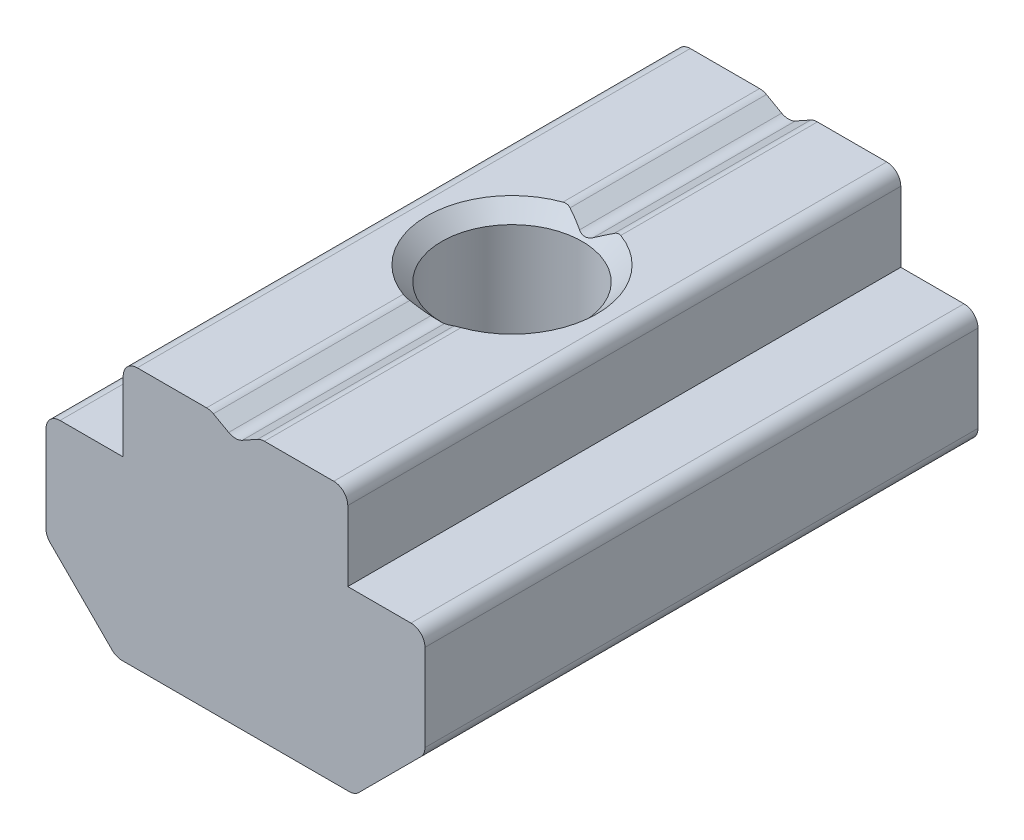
ISO-10303-21;
HEADER;
FILE_DESCRIPTION(('STEP AP214'),'2;1');
FILE_NAME('part.step','',(''),(''),'','','');
FILE_SCHEMA(('AUTOMOTIVE_DESIGN { 1 0 10303 214 1 1 1 1 }'));
ENDSEC;
DATA;
#1=APPLICATION_CONTEXT('core data for automotive mechanical design processes');
#2=APPLICATION_PROTOCOL_DEFINITION('international standard','automotive_design',2000,#1);
#3=PRODUCT_CONTEXT('',#1,'mechanical');
#4=PRODUCT('Part','Part','',(#3));
#5=PRODUCT_RELATED_PRODUCT_CATEGORY('part','',(#4));
#6=PRODUCT_DEFINITION_FORMATION('','',#4);
#7=PRODUCT_DEFINITION_CONTEXT('part definition',#1,'design');
#8=PRODUCT_DEFINITION('design','',#6,#7);
#9=PRODUCT_DEFINITION_SHAPE('','',#8);
#10=(LENGTH_UNIT() NAMED_UNIT(*) SI_UNIT(.MILLI.,.METRE.));
#11=(NAMED_UNIT(*) PLANE_ANGLE_UNIT() SI_UNIT($,.RADIAN.));
#12=(NAMED_UNIT(*) SI_UNIT($,.STERADIAN.) SOLID_ANGLE_UNIT());
#13=UNCERTAINTY_MEASURE_WITH_UNIT(LENGTH_MEASURE(1.E-05),#10,'distance_accuracy_value','');
#14=(GEOMETRIC_REPRESENTATION_CONTEXT(3) GLOBAL_UNCERTAINTY_ASSIGNED_CONTEXT((#13)) GLOBAL_UNIT_ASSIGNED_CONTEXT((#10,
#11,#12)) REPRESENTATION_CONTEXT('',''));
#15=CARTESIAN_POINT('',(0.,0.,0.));
#16=DIRECTION('',(0.,0.,1.));
#17=DIRECTION('',(1.,0.,0.));
#18=AXIS2_PLACEMENT_3D('',#15,#16,#17);
#19=CARTESIAN_POINT('',(0.,9.3,0.));
#20=DIRECTION('',(0.,0.,-1.));
#21=DIRECTION('',(-1.,0.,0.));
#22=AXIS2_PLACEMENT_3D('',#19,#20,#21);
#23=PLANE('',#22);
#24=DIRECTION('',(1.,0.,0.));
#25=VECTOR('',#24,1.);
#26=CARTESIAN_POINT('',(0.,9.3,0.));
#27=LINE('',#26,#25);
#28=CARTESIAN_POINT('',(7.7795630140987,9.3,0.));
#29=VERTEX_POINT('',#28);
#30=CARTESIAN_POINT('',(10.25,9.3,0.));
#31=VERTEX_POINT('',#30);
#32=EDGE_CURVE('E304',#29,#31,#27,.T.);
#33=ORIENTED_EDGE('',*,*,#32,.F.);
#34=CARTESIAN_POINT('',(7.7795630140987,8.8,0.));
#35=DIRECTION('',(0.,0.,-1.));
#36=DIRECTION('',(-1.,0.,0.));
#37=AXIS2_PLACEMENT_3D('',#34,#35,#36);
#38=CIRCLE('',#37,0.5);
#39=CARTESIAN_POINT('',(7.53674154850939,9.23707863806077,0.));
#40=VERTEX_POINT('',#39);
#41=EDGE_CURVE('E424',#29,#40,#38,.F.);
#42=ORIENTED_EDGE('',*,*,#41,.T.);
#43=DIRECTION('',(-0.874157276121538,-0.485642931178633,0.));
#44=VECTOR('',#43,1.);
#45=CARTESIAN_POINT('',(-2.1438679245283,3.85896226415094,0.));
#46=LINE('',#45,#44);
#47=CARTESIAN_POINT('',(6.99282146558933,8.93490081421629,0.));
#48=VERTEX_POINT('',#47);
#49=EDGE_CURVE('E680',#40,#48,#46,.T.);
#50=ORIENTED_EDGE('',*,*,#49,.T.);
#51=CARTESIAN_POINT('',(6.75000000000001,9.37197945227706,0.));
#52=DIRECTION('',(0.,0.,-1.));
#53=DIRECTION('',(-1.,0.,0.));
#54=AXIS2_PLACEMENT_3D('',#51,#52,#53);
#55=CIRCLE('',#54,0.5);
#56=CARTESIAN_POINT('',(6.50717853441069,8.93490081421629,0.));
#57=VERTEX_POINT('',#56);
#58=EDGE_CURVE('E60',#48,#57,#55,.T.);
#59=ORIENTED_EDGE('',*,*,#58,.T.);
#60=DIRECTION('',(0.874157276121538,-0.485642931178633,0.));
#61=VECTOR('',#60,1.);
#62=CARTESIAN_POINT('',(5.32783018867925,9.59009433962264,0.));
#63=LINE('',#62,#61);
#64=CARTESIAN_POINT('',(5.96325845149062,9.23707863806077,0.));
#65=VERTEX_POINT('',#64);
#66=EDGE_CURVE('E670',#65,#57,#63,.T.);
#67=ORIENTED_EDGE('',*,*,#66,.F.);
#68=CARTESIAN_POINT('',(5.72043698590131,8.8,0.));
#69=DIRECTION('',(0.,0.,-1.));
#70=DIRECTION('',(-1.,0.,0.));
#71=AXIS2_PLACEMENT_3D('',#68,#69,#70);
#72=CIRCLE('',#71,0.5);
#73=CARTESIAN_POINT('',(5.72043698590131,9.3,0.));
#74=VERTEX_POINT('',#73);
#75=EDGE_CURVE('E421',#65,#74,#72,.F.);
#76=ORIENTED_EDGE('',*,*,#75,.T.);
#77=CARTESIAN_POINT('',(3.25,9.3,0.));
#78=VERTEX_POINT('',#77);
#79=EDGE_CURVE('E299',#78,#74,#27,.T.);
#80=ORIENTED_EDGE('',*,*,#79,.F.);
#81=CARTESIAN_POINT('',(3.25,8.8,0.));
#82=DIRECTION('',(0.,0.,-1.));
#83=DIRECTION('',(-1.,0.,0.));
#84=AXIS2_PLACEMENT_3D('',#81,#82,#83);
#85=CIRCLE('',#84,0.5);
#86=CARTESIAN_POINT('',(2.75,8.8,0.));
#87=VERTEX_POINT('',#86);
#88=EDGE_CURVE('E397',#78,#87,#85,.F.);
#89=ORIENTED_EDGE('',*,*,#88,.T.);
#90=DIRECTION('',(0.,1.,0.));
#91=VECTOR('',#90,1.);
#92=CARTESIAN_POINT('',(2.75,6.3,0.));
#93=LINE('',#92,#91);
#94=CARTESIAN_POINT('',(2.75,6.3,0.));
#95=VERTEX_POINT('',#94);
#96=EDGE_CURVE('E256',#95,#87,#93,.T.);
#97=ORIENTED_EDGE('',*,*,#96,.F.);
#98=DIRECTION('',(1.,0.,0.));
#99=VECTOR('',#98,1.);
#100=CARTESIAN_POINT('',(0.,6.3,0.));
#101=LINE('',#100,#99);
#102=CARTESIAN_POINT('',(0.5,6.3,0.));
#103=VERTEX_POINT('',#102);
#104=EDGE_CURVE('E257',#103,#95,#101,.T.);
#105=ORIENTED_EDGE('',*,*,#104,.F.);
#106=CARTESIAN_POINT('',(0.5,5.8,0.));
#107=DIRECTION('',(0.,0.,-1.));
#108=DIRECTION('',(-1.,0.,0.));
#109=AXIS2_PLACEMENT_3D('',#106,#107,#108);
#110=CIRCLE('',#109,0.5);
#111=CARTESIAN_POINT('',(0.,5.8,0.));
#112=VERTEX_POINT('',#111);
#113=EDGE_CURVE('E400',#103,#112,#110,.F.);
#114=ORIENTED_EDGE('',*,*,#113,.T.);
#115=DIRECTION('',(0.,-1.,0.));
#116=VECTOR('',#115,1.);
#117=CARTESIAN_POINT('',(0.,9.3,0.));
#118=LINE('',#117,#116);
#119=CARTESIAN_POINT('',(0.,2.70710678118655,0.));
#120=VERTEX_POINT('',#119);
#121=EDGE_CURVE('E328',#112,#120,#118,.T.);
#122=ORIENTED_EDGE('',*,*,#121,.T.);
#123=CARTESIAN_POINT('',(0.5,2.70710678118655,0.));
#124=DIRECTION('',(0.,0.,-1.));
#125=DIRECTION('',(-1.,0.,0.));
#126=AXIS2_PLACEMENT_3D('',#123,#124,#125);
#127=CIRCLE('',#126,0.5);
#128=CARTESIAN_POINT('',(0.146446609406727,2.35355339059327,0.));
#129=VERTEX_POINT('',#128);
#130=EDGE_CURVE('E418',#120,#129,#127,.F.);
#131=ORIENTED_EDGE('',*,*,#130,.T.);
#132=DIRECTION('',(0.707106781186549,-0.707106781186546,0.));
#133=VECTOR('',#132,1.);
#134=CARTESIAN_POINT('',(0.,2.5,0.));
#135=LINE('',#134,#133);
#136=CARTESIAN_POINT('',(2.35355339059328,0.146446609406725,0.));
#137=VERTEX_POINT('',#136);
#138=EDGE_CURVE('E336',#129,#137,#135,.T.);
#139=ORIENTED_EDGE('',*,*,#138,.T.);
#140=CARTESIAN_POINT('',(2.70710678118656,0.5,0.));
#141=DIRECTION('',(0.,0.,-1.));
#142=DIRECTION('',(-1.,0.,0.));
#143=AXIS2_PLACEMENT_3D('',#140,#141,#142);
#144=CIRCLE('',#143,0.5);
#145=CARTESIAN_POINT('',(2.70710678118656,0.,0.));
#146=VERTEX_POINT('',#145);
#147=EDGE_CURVE('E415',#137,#146,#144,.F.);
#148=ORIENTED_EDGE('',*,*,#147,.T.);
#149=DIRECTION('',(1.,0.,0.));
#150=VECTOR('',#149,1.);
#151=CARTESIAN_POINT('',(0.,0.,0.));
#152=LINE('',#151,#150);
#153=CARTESIAN_POINT('',(10.7928932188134,0.,0.));
#154=VERTEX_POINT('',#153);
#155=EDGE_CURVE('E278',#146,#154,#152,.T.);
#156=ORIENTED_EDGE('',*,*,#155,.T.);
#157=CARTESIAN_POINT('',(10.7928932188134,0.5,0.));
#158=DIRECTION('',(0.,0.,-1.));
#159=DIRECTION('',(-1.,0.,0.));
#160=AXIS2_PLACEMENT_3D('',#157,#158,#159);
#161=CIRCLE('',#160,0.5);
#162=CARTESIAN_POINT('',(11.1464466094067,0.146446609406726,0.));
#163=VERTEX_POINT('',#162);
#164=EDGE_CURVE('E412',#154,#163,#161,.F.);
#165=ORIENTED_EDGE('',*,*,#164,.T.);
#166=DIRECTION('',(0.707106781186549,0.707106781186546,0.));
#167=VECTOR('',#166,1.);
#168=CARTESIAN_POINT('',(13.5,2.5,0.));
#169=LINE('',#168,#167);
#170=CARTESIAN_POINT('',(13.3535533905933,2.35355339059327,0.));
#171=VERTEX_POINT('',#170);
#172=EDGE_CURVE('E332',#163,#171,#169,.T.);
#173=ORIENTED_EDGE('',*,*,#172,.T.);
#174=CARTESIAN_POINT('',(13.,2.70710678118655,0.));
#175=DIRECTION('',(0.,0.,-1.));
#176=DIRECTION('',(-1.,0.,0.));
#177=AXIS2_PLACEMENT_3D('',#174,#175,#176);
#178=CIRCLE('',#177,0.5);
#179=CARTESIAN_POINT('',(13.5,2.70710678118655,0.));
#180=VERTEX_POINT('',#179);
#181=EDGE_CURVE('E409',#171,#180,#178,.F.);
#182=ORIENTED_EDGE('',*,*,#181,.T.);
#183=DIRECTION('',(0.,-1.,0.));
#184=VECTOR('',#183,1.);
#185=CARTESIAN_POINT('',(13.5,9.3,0.));
#186=LINE('',#185,#184);
#187=CARTESIAN_POINT('',(13.5,5.8,0.));
#188=VERTEX_POINT('',#187);
#189=EDGE_CURVE('E324',#188,#180,#186,.T.);
#190=ORIENTED_EDGE('',*,*,#189,.F.);
#191=CARTESIAN_POINT('',(13.,5.8,0.));
#192=DIRECTION('',(0.,0.,-1.));
#193=DIRECTION('',(-1.,0.,0.));
#194=AXIS2_PLACEMENT_3D('',#191,#192,#193);
#195=CIRCLE('',#194,0.5);
#196=CARTESIAN_POINT('',(13.,6.3,0.));
#197=VERTEX_POINT('',#196);
#198=EDGE_CURVE('E403',#188,#197,#195,.F.);
#199=ORIENTED_EDGE('',*,*,#198,.T.);
#200=DIRECTION('',(1.,0.,0.));
#201=VECTOR('',#200,1.);
#202=CARTESIAN_POINT('',(0.,6.3,0.));
#203=LINE('',#202,#201);
#204=CARTESIAN_POINT('',(10.75,6.3,0.));
#205=VERTEX_POINT('',#204);
#206=EDGE_CURVE('E288',#205,#197,#203,.T.);
#207=ORIENTED_EDGE('',*,*,#206,.F.);
#208=DIRECTION('',(0.,1.,0.));
#209=VECTOR('',#208,1.);
#210=CARTESIAN_POINT('',(10.75,6.3,0.));
#211=LINE('',#210,#209);
#212=CARTESIAN_POINT('',(10.75,8.8,0.));
#213=VERTEX_POINT('',#212);
#214=EDGE_CURVE('E266',#205,#213,#211,.T.);
#215=ORIENTED_EDGE('',*,*,#214,.T.);
#216=CARTESIAN_POINT('',(10.25,8.8,0.));
#217=DIRECTION('',(0.,0.,-1.));
#218=DIRECTION('',(-1.,0.,0.));
#219=AXIS2_PLACEMENT_3D('',#216,#217,#218);
#220=CIRCLE('',#219,0.5);
#221=EDGE_CURVE('E406',#213,#31,#220,.F.);
#222=ORIENTED_EDGE('',*,*,#221,.T.);
#223=EDGE_LOOP('',(#33,#42,#50,#59,#67,#76,#80,#89,#97,#105,#114,#122,#131,#139,#148,#156,#165,
#173,#182,#190,#199,#207,#215,#222));
#224=FACE_BOUND('',#223,.T.);
#225=ADVANCED_FACE('F45',(#224),#23,.F.);
#226=CARTESIAN_POINT('',(0.,9.3,-19.7));
#227=DIRECTION('',(0.,0.,1.));
#228=DIRECTION('',(1.,0.,0.));
#229=AXIS2_PLACEMENT_3D('',#226,#227,#228);
#230=PLANE('',#229);
#231=DIRECTION('',(0.874157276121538,0.485642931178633,0.));
#232=VECTOR('',#231,1.);
#233=CARTESIAN_POINT('',(-2.1438679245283,3.85896226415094,-19.7));
#234=LINE('',#233,#232);
#235=CARTESIAN_POINT('',(6.99282146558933,8.93490081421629,-19.7));
#236=VERTEX_POINT('',#235);
#237=CARTESIAN_POINT('',(7.53674154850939,9.23707863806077,-19.7));
#238=VERTEX_POINT('',#237);
#239=EDGE_CURVE('E683',#236,#238,#234,.T.);
#240=ORIENTED_EDGE('',*,*,#239,.T.);
#241=CARTESIAN_POINT('',(7.7795630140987,8.8,-19.7));
#242=DIRECTION('',(0.,0.,1.));
#243=DIRECTION('',(1.,0.,0.));
#244=AXIS2_PLACEMENT_3D('',#241,#242,#243);
#245=CIRCLE('',#244,0.5);
#246=CARTESIAN_POINT('',(7.7795630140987,9.3,-19.7));
#247=VERTEX_POINT('',#246);
#248=EDGE_CURVE('E621',#238,#247,#245,.F.);
#249=ORIENTED_EDGE('',*,*,#248,.T.);
#250=DIRECTION('',(-1.,0.,0.));
#251=VECTOR('',#250,1.);
#252=CARTESIAN_POINT('',(0.,9.3,-19.7));
#253=LINE('',#252,#251);
#254=CARTESIAN_POINT('',(10.25,9.3,-19.7));
#255=VERTEX_POINT('',#254);
#256=EDGE_CURVE('E308',#255,#247,#253,.T.);
#257=ORIENTED_EDGE('',*,*,#256,.F.);
#258=CARTESIAN_POINT('',(10.25,8.8,-19.7));
#259=DIRECTION('',(0.,0.,1.));
#260=DIRECTION('',(1.,0.,0.));
#261=AXIS2_PLACEMENT_3D('',#258,#259,#260);
#262=CIRCLE('',#261,0.5);
#263=CARTESIAN_POINT('',(10.75,8.8,-19.7));
#264=VERTEX_POINT('',#263);
#265=EDGE_CURVE('E596',#255,#264,#262,.F.);
#266=ORIENTED_EDGE('',*,*,#265,.T.);
#267=DIRECTION('',(0.,1.,0.));
#268=VECTOR('',#267,1.);
#269=CARTESIAN_POINT('',(10.75,6.3,-19.7));
#270=LINE('',#269,#268);
#271=CARTESIAN_POINT('',(10.75,6.3,-19.7));
#272=VERTEX_POINT('',#271);
#273=EDGE_CURVE('E292',#272,#264,#270,.T.);
#274=ORIENTED_EDGE('',*,*,#273,.F.);
#275=DIRECTION('',(-1.,0.,0.));
#276=VECTOR('',#275,1.);
#277=CARTESIAN_POINT('',(0.,6.3,-19.7));
#278=LINE('',#277,#276);
#279=CARTESIAN_POINT('',(13.,6.3,-19.7));
#280=VERTEX_POINT('',#279);
#281=EDGE_CURVE('E280',#280,#272,#278,.T.);
#282=ORIENTED_EDGE('',*,*,#281,.F.);
#283=CARTESIAN_POINT('',(13.,5.8,-19.7));
#284=DIRECTION('',(0.,0.,1.));
#285=DIRECTION('',(1.,0.,0.));
#286=AXIS2_PLACEMENT_3D('',#283,#284,#285);
#287=CIRCLE('',#286,0.5);
#288=CARTESIAN_POINT('',(13.5,5.8,-19.7));
#289=VERTEX_POINT('',#288);
#290=EDGE_CURVE('E645',#280,#289,#287,.F.);
#291=ORIENTED_EDGE('',*,*,#290,.T.);
#292=DIRECTION('',(0.,-1.,0.));
#293=VECTOR('',#292,1.);
#294=CARTESIAN_POINT('',(13.5,9.3,-19.7));
#295=LINE('',#294,#293);
#296=CARTESIAN_POINT('',(13.5,2.70710678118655,-19.7));
#297=VERTEX_POINT('',#296);
#298=EDGE_CURVE('E320',#289,#297,#295,.T.);
#299=ORIENTED_EDGE('',*,*,#298,.T.);
#300=CARTESIAN_POINT('',(13.,2.70710678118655,-19.7));
#301=DIRECTION('',(0.,0.,1.));
#302=DIRECTION('',(1.,0.,0.));
#303=AXIS2_PLACEMENT_3D('',#300,#301,#302);
#304=CIRCLE('',#303,0.5);
#305=CARTESIAN_POINT('',(13.3535533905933,2.35355339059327,-19.7));
#306=VERTEX_POINT('',#305);
#307=EDGE_CURVE('E593',#297,#306,#304,.F.);
#308=ORIENTED_EDGE('',*,*,#307,.T.);
#309=DIRECTION('',(-0.707106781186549,-0.707106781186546,0.));
#310=VECTOR('',#309,1.);
#311=CARTESIAN_POINT('',(13.5,2.5,-19.7));
#312=LINE('',#311,#310);
#313=CARTESIAN_POINT('',(11.1464466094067,0.146446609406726,-19.7));
#314=VERTEX_POINT('',#313);
#315=EDGE_CURVE('E340',#306,#314,#312,.T.);
#316=ORIENTED_EDGE('',*,*,#315,.T.);
#317=CARTESIAN_POINT('',(10.7928932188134,0.5,-19.7));
#318=DIRECTION('',(0.,0.,1.));
#319=DIRECTION('',(1.,0.,0.));
#320=AXIS2_PLACEMENT_3D('',#317,#318,#319);
#321=CIRCLE('',#320,0.5);
#322=CARTESIAN_POINT('',(10.7928932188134,0.,-19.7));
#323=VERTEX_POINT('',#322);
#324=EDGE_CURVE('E595',#314,#323,#321,.F.);
#325=ORIENTED_EDGE('',*,*,#324,.T.);
#326=DIRECTION('',(-1.,0.,0.));
#327=VECTOR('',#326,1.);
#328=CARTESIAN_POINT('',(0.,0.,-19.7));
#329=LINE('',#328,#327);
#330=CARTESIAN_POINT('',(2.70710678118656,0.,-19.7));
#331=VERTEX_POINT('',#330);
#332=EDGE_CURVE('E312',#323,#331,#329,.T.);
#333=ORIENTED_EDGE('',*,*,#332,.T.);
#334=CARTESIAN_POINT('',(2.70710678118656,0.5,-19.7));
#335=DIRECTION('',(0.,0.,1.));
#336=DIRECTION('',(1.,0.,0.));
#337=AXIS2_PLACEMENT_3D('',#334,#335,#336);
#338=CIRCLE('',#337,0.5);
#339=CARTESIAN_POINT('',(2.35355339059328,0.146446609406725,-19.7));
#340=VERTEX_POINT('',#339);
#341=EDGE_CURVE('E637',#331,#340,#338,.F.);
#342=ORIENTED_EDGE('',*,*,#341,.T.);
#343=DIRECTION('',(-0.707106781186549,0.707106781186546,0.));
#344=VECTOR('',#343,1.);
#345=CARTESIAN_POINT('',(0.,2.5,-19.7));
#346=LINE('',#345,#344);
#347=CARTESIAN_POINT('',(0.146446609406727,2.35355339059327,-19.7));
#348=VERTEX_POINT('',#347);
#349=EDGE_CURVE('E344',#340,#348,#346,.T.);
#350=ORIENTED_EDGE('',*,*,#349,.T.);
#351=CARTESIAN_POINT('',(0.5,2.70710678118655,-19.7));
#352=DIRECTION('',(0.,0.,1.));
#353=DIRECTION('',(1.,0.,0.));
#354=AXIS2_PLACEMENT_3D('',#351,#352,#353);
#355=CIRCLE('',#354,0.5);
#356=CARTESIAN_POINT('',(0.,2.70710678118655,-19.7));
#357=VERTEX_POINT('',#356);
#358=EDGE_CURVE('E551',#348,#357,#355,.F.);
#359=ORIENTED_EDGE('',*,*,#358,.T.);
#360=DIRECTION('',(0.,-1.,0.));
#361=VECTOR('',#360,1.);
#362=CARTESIAN_POINT('',(0.,9.3,-19.7));
#363=LINE('',#362,#361);
#364=CARTESIAN_POINT('',(0.,5.8,-19.7));
#365=VERTEX_POINT('',#364);
#366=EDGE_CURVE('E316',#365,#357,#363,.T.);
#367=ORIENTED_EDGE('',*,*,#366,.F.);
#368=CARTESIAN_POINT('',(0.5,5.8,-19.7));
#369=DIRECTION('',(0.,0.,1.));
#370=DIRECTION('',(1.,0.,0.));
#371=AXIS2_PLACEMENT_3D('',#368,#369,#370);
#372=CIRCLE('',#371,0.5);
#373=CARTESIAN_POINT('',(0.5,6.3,-19.7));
#374=VERTEX_POINT('',#373);
#375=EDGE_CURVE('E75',#365,#374,#372,.F.);
#376=ORIENTED_EDGE('',*,*,#375,.T.);
#377=DIRECTION('',(-1.,0.,0.));
#378=VECTOR('',#377,1.);
#379=CARTESIAN_POINT('',(0.,6.3,-19.7));
#380=LINE('',#379,#378);
#381=CARTESIAN_POINT('',(2.75,6.3,-19.7));
#382=VERTEX_POINT('',#381);
#383=EDGE_CURVE('E262',#382,#374,#380,.T.);
#384=ORIENTED_EDGE('',*,*,#383,.F.);
#385=DIRECTION('',(0.,1.,0.));
#386=VECTOR('',#385,1.);
#387=CARTESIAN_POINT('',(2.75,6.3,-19.7));
#388=LINE('',#387,#386);
#389=CARTESIAN_POINT('',(2.75,8.8,-19.7));
#390=VERTEX_POINT('',#389);
#391=EDGE_CURVE('E249',#382,#390,#388,.T.);
#392=ORIENTED_EDGE('',*,*,#391,.T.);
#393=CARTESIAN_POINT('',(3.25,8.8,-19.7));
#394=DIRECTION('',(0.,0.,1.));
#395=DIRECTION('',(1.,0.,0.));
#396=AXIS2_PLACEMENT_3D('',#393,#394,#395);
#397=CIRCLE('',#396,0.5);
#398=CARTESIAN_POINT('',(3.25,9.3,-19.7));
#399=VERTEX_POINT('',#398);
#400=EDGE_CURVE('E650',#390,#399,#397,.F.);
#401=ORIENTED_EDGE('',*,*,#400,.T.);
#402=CARTESIAN_POINT('',(5.72043698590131,9.3,-19.7));
#403=VERTEX_POINT('',#402);
#404=EDGE_CURVE('E303',#403,#399,#253,.T.);
#405=ORIENTED_EDGE('',*,*,#404,.F.);
#406=CARTESIAN_POINT('',(5.72043698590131,8.8,-19.7));
#407=DIRECTION('',(0.,0.,1.));
#408=DIRECTION('',(1.,0.,0.));
#409=AXIS2_PLACEMENT_3D('',#406,#407,#408);
#410=CIRCLE('',#409,0.5);
#411=CARTESIAN_POINT('',(5.96325845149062,9.23707863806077,-19.7));
#412=VERTEX_POINT('',#411);
#413=EDGE_CURVE('E625',#403,#412,#410,.F.);
#414=ORIENTED_EDGE('',*,*,#413,.T.);
#415=DIRECTION('',(-0.874157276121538,0.485642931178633,0.));
#416=VECTOR('',#415,1.);
#417=CARTESIAN_POINT('',(5.32783018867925,9.59009433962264,-19.7));
#418=LINE('',#417,#416);
#419=CARTESIAN_POINT('',(6.50717853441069,8.93490081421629,-19.7));
#420=VERTEX_POINT('',#419);
#421=EDGE_CURVE('E686',#420,#412,#418,.T.);
#422=ORIENTED_EDGE('',*,*,#421,.F.);
#423=CARTESIAN_POINT('',(6.75000000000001,9.37197945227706,-19.7));
#424=DIRECTION('',(0.,0.,1.));
#425=DIRECTION('',(1.,0.,0.));
#426=AXIS2_PLACEMENT_3D('',#423,#424,#425);
#427=CIRCLE('',#426,0.5);
#428=EDGE_CURVE('E486',#420,#236,#427,.T.);
#429=ORIENTED_EDGE('',*,*,#428,.T.);
#430=EDGE_LOOP('',(#240,#249,#257,#266,#274,#282,#291,#299,#308,#316,#325,#333,#342,#350,#359,
#367,#376,#384,#392,#401,#405,#414,#422,#429));
#431=FACE_BOUND('',#430,.T.);
#432=ADVANCED_FACE('F269',(#431),#230,.F.);
#433=CARTESIAN_POINT('',(0.,9.3,0.));
#434=DIRECTION('',(0.,-1.,0.));
#435=DIRECTION('',(0.,0.,-1.));
#436=AXIS2_PLACEMENT_3D('',#433,#434,#435);
#437=PLANE('',#436);
#438=CARTESIAN_POINT('',(6.75,9.3,-9.85));
#439=DIRECTION('',(0.,1.,0.));
#440=DIRECTION('',(0.,0.,1.));
#441=AXIS2_PLACEMENT_3D('',#438,#439,#440);
#442=CIRCLE('',#441,3.025);
#443=CARTESIAN_POINT('',(7.7795630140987,9.3,-7.0055976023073));
#444=VERTEX_POINT('',#443);
#445=CARTESIAN_POINT('',(7.7795630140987,9.3,-12.6944023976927));
#446=VERTEX_POINT('',#445);
#447=EDGE_CURVE('E613',#444,#446,#442,.T.);
#448=ORIENTED_EDGE('',*,*,#447,.F.);
#449=DIRECTION('',(0.,0.,1.));
#450=VECTOR('',#449,1.);
#451=CARTESIAN_POINT('',(7.7795630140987,9.3,0.));
#452=LINE('',#451,#450);
#453=EDGE_CURVE('E393',#444,#29,#452,.T.);
#454=ORIENTED_EDGE('',*,*,#453,.T.);
#455=ORIENTED_EDGE('',*,*,#32,.T.);
#456=DIRECTION('',(0.,0.,1.));
#457=VECTOR('',#456,1.);
#458=CARTESIAN_POINT('',(10.25,9.3,0.));
#459=LINE('',#458,#457);
#460=EDGE_CURVE('E386',#31,#255,#459,.F.);
#461=ORIENTED_EDGE('',*,*,#460,.T.);
#462=ORIENTED_EDGE('',*,*,#256,.T.);
#463=DIRECTION('',(0.,0.,1.));
#464=VECTOR('',#463,1.);
#465=CARTESIAN_POINT('',(7.7795630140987,9.3,-12.7380140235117));
#466=LINE('',#465,#464);
#467=EDGE_CURVE('E389',#247,#446,#466,.T.);
#468=ORIENTED_EDGE('',*,*,#467,.T.);
#469=EDGE_LOOP('',(#448,#454,#455,#461,#462,#468));
#470=FACE_BOUND('',#469,.T.);
#471=ADVANCED_FACE('F451',(#470),#437,.F.);
#472=CARTESIAN_POINT('',(6.75,9.3,-9.85));
#473=DIRECTION('',(0.,1.,0.));
#474=DIRECTION('',(0.,0.,1.));
#475=AXIS2_PLACEMENT_3D('',#472,#473,#474);
#476=CONICAL_SURFACE('',#475,3.025,0.785398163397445);
#477=CARTESIAN_POINT('',(6.75,8.775,-9.85));
#478=DIRECTION('',(0.,1.,0.));
#479=DIRECTION('',(0.,0.,1.));
#480=AXIS2_PLACEMENT_3D('',#477,#478,#479);
#481=CIRCLE('',#480,2.5);
#482=CARTESIAN_POINT('',(6.75,8.775,-7.35));
#483=VERTEX_POINT('',#482);
#484=EDGE_CURVE('E698',#483,#483,#481,.T.);
#485=ORIENTED_EDGE('',*,*,#484,.F.);
#486=EDGE_LOOP('',(#485));
#487=FACE_BOUND('',#486,.T.);
#488=CARTESIAN_POINT('',(8.77901785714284,9.92723214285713,-9.85));
#489=DIRECTION('',(-0.485642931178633,0.874157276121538,0.));
#490=DIRECTION('',(0.874157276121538,0.485642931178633,0.));
#491=AXIS2_PLACEMENT_3D('',#488,#489,#490);
#492=ELLIPSE('',#491,4.17800348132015,3.03675586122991);
#493=CARTESIAN_POINT('',(7.53674154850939,9.23707863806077,-6.99431311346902));
#494=VERTEX_POINT('',#493);
#495=CARTESIAN_POINT('',(6.99282146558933,8.93490081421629,-7.2012059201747));
#496=VERTEX_POINT('',#495);
#497=EDGE_CURVE('E353',#494,#496,#492,.F.);
#498=ORIENTED_EDGE('',*,*,#497,.F.);
#499=CARTESIAN_POINT('',(7.53674154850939,9.23707863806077,-6.99431311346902));
#500=CARTESIAN_POINT('',(7.55232730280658,9.2457696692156,-6.98958949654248));
#501=CARTESIAN_POINT('',(7.5686790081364,9.25373000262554,-6.9859395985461));
#502=CARTESIAN_POINT('',(7.60242480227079,9.26792002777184,-6.98099698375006));
#503=CARTESIAN_POINT('',(7.61981751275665,9.27415194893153,-6.97970121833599));
#504=CARTESIAN_POINT('',(7.65526015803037,9.28465801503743,-6.97966323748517));
#505=CARTESIAN_POINT('',(7.67331216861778,9.28892527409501,-6.98092992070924));
#506=CARTESIAN_POINT('',(7.70940935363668,9.29539248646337,-6.98597750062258));
#507=CARTESIAN_POINT('',(7.72745450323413,9.29759527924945,-6.98975493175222));
#508=CARTESIAN_POINT('',(7.75101899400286,9.29921866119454,-6.99624880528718));
#509=CARTESIAN_POINT('',(7.75678033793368,9.29951373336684,-6.99796336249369));
#510=CARTESIAN_POINT('',(7.7682275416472,9.29990407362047,-7.00161569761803));
#511=CARTESIAN_POINT('',(7.77391351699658,9.29999969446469,-7.00355307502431));
#512=CARTESIAN_POINT('',(7.7795630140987,9.3,-7.0055976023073));
#513=B_SPLINE_CURVE_WITH_KNOTS('',3,(#499,#500,#501,#502,#503,#504,#505,#506,#507,#508,#509,
#510,#511,#512),.UNSPECIFIED.,.F.,.F.,(4,2,2,2,2,2,4),(0.,0.0553649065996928,0.110658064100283,
0.166143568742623,0.221552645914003,0.239602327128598,0.25762005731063),.UNSPECIFIED.);
#514=EDGE_CURVE('E469',#494,#444,#513,.T.);
#515=ORIENTED_EDGE('',*,*,#514,.T.);
#516=ORIENTED_EDGE('',*,*,#447,.T.);
#517=CARTESIAN_POINT('',(7.7795630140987,9.3,-12.6944023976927));
#518=CARTESIAN_POINT('',(7.76221561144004,9.3000261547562,-12.7007162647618));
#519=CARTESIAN_POINT('',(7.74444860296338,9.29909806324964,-12.7059737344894));
#520=CARTESIAN_POINT('',(7.7086113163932,9.29526102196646,-12.7141515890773));
#521=CARTESIAN_POINT('',(7.69054125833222,9.29235345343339,-12.7170736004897));
#522=CARTESIAN_POINT('',(7.65454017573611,9.28447044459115,-12.7203718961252));
#523=CARTESIAN_POINT('',(7.63660993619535,9.27948721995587,-12.7207385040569));
#524=CARTESIAN_POINT('',(7.60155815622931,9.26760623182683,-12.7189393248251));
#525=CARTESIAN_POINT('',(7.58443535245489,9.26071158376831,-12.716777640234));
#526=CARTESIAN_POINT('',(7.56260628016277,9.25051627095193,-12.7124101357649));
#527=CARTESIAN_POINT('',(7.55733109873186,9.24793673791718,-12.7112219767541));
#528=CARTESIAN_POINT('',(7.54692751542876,9.24262243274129,-12.7086204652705));
#529=CARTESIAN_POINT('',(7.54179888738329,9.23988792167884,-12.7072074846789));
#530=CARTESIAN_POINT('',(7.53674154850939,9.23707863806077,-12.705686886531));
#531=B_SPLINE_CURVE_WITH_KNOTS('',3,(#517,#518,#519,#520,#521,#522,#523,#524,#525,#526,#527,
#528,#529,#530),.UNSPECIFIED.,.F.,.F.,(4,2,2,2,2,2,4),(0.,0.0553752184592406,0.110711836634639,
0.16625787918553,0.221713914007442,0.239681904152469,0.257620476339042),.UNSPECIFIED.);
#532=CARTESIAN_POINT('',(7.53674154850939,9.23707863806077,-12.705686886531));
#533=VERTEX_POINT('',#532);
#534=EDGE_CURVE('E435',#446,#533,#531,.T.);
#535=ORIENTED_EDGE('',*,*,#534,.T.);
#536=CARTESIAN_POINT('',(6.99282146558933,8.93490081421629,-12.4987940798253));
#537=VERTEX_POINT('',#536);
#538=EDGE_CURVE('E354',#537,#533,#492,.F.);
#539=ORIENTED_EDGE('',*,*,#538,.F.);
#540=CARTESIAN_POINT('',(6.99282146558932,8.93490081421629,-12.4987940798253));
#541=CARTESIAN_POINT('',(6.97401216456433,8.92442171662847,-12.4900007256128));
#542=CARTESIAN_POINT('',(6.95412066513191,8.91499127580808,-12.4821674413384));
#543=CARTESIAN_POINT('',(6.91257652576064,8.89862729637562,-12.4686623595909));
#544=CARTESIAN_POINT('',(6.89091858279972,8.89170164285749,-12.4629973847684));
#545=CARTESIAN_POINT('',(6.84628701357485,8.88079778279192,-12.4541123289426));
#546=CARTESIAN_POINT('',(6.82330888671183,8.87683039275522,-12.4509012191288));
#547=CARTESIAN_POINT('',(6.77685705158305,8.87215776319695,-12.4471219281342));
#548=CARTESIAN_POINT('',(6.75338456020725,8.8714452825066,-12.4465478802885));
#549=CARTESIAN_POINT('',(6.7079128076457,8.87326210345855,-12.4480154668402));
#550=CARTESIAN_POINT('',(6.68590181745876,8.87562030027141,-12.4499190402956));
#551=CARTESIAN_POINT('',(6.64265907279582,8.88314388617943,-12.4560230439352));
#552=CARTESIAN_POINT('',(6.62142859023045,8.88831365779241,-12.4602270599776));
#553=CARTESIAN_POINT('',(6.58422450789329,8.89993794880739,-12.4697494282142));
#554=CARTESIAN_POINT('',(6.5680183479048,8.90596193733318,-12.4747044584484));
#555=CARTESIAN_POINT('',(6.53673145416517,8.91942346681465,-12.4858533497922));
#556=CARTESIAN_POINT('',(6.52164666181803,8.92685552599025,-12.492042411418));
#557=CARTESIAN_POINT('',(6.50717853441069,8.93490081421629,-12.4987940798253));
#558=B_SPLINE_CURVE_WITH_KNOTS('',3,(#540,#541,#542,#543,#544,#545,#546,#547,#548,#549,#550,
#551,#552,#553,#554,#555,#556,#557),.UNSPECIFIED.,.F.,.F.,(4,2,2,2,2,2,2,2,4),(0.,
0.069768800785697,0.139755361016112,0.209996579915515,0.280081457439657,0.346423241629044,
0.412868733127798,0.466693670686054,0.520313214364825),.UNSPECIFIED.);
#559=CARTESIAN_POINT('',(6.50717853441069,8.93490081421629,-12.4987940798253));
#560=VERTEX_POINT('',#559);
#561=EDGE_CURVE('E477',#537,#560,#558,.T.);
#562=ORIENTED_EDGE('',*,*,#561,.T.);
#563=CARTESIAN_POINT('',(4.72098214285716,9.92723214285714,-9.85));
#564=DIRECTION('',(-0.485642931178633,-0.874157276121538,0.));
#565=DIRECTION('',(-0.874157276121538,0.485642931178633,0.));
#566=AXIS2_PLACEMENT_3D('',#563,#564,#565);
#567=ELLIPSE('',#566,4.17800348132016,3.03675586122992);
#568=CARTESIAN_POINT('',(5.96325845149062,9.23707863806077,-12.705686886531));
#569=VERTEX_POINT('',#568);
#570=EDGE_CURVE('E348',#560,#569,#567,.F.);
#571=ORIENTED_EDGE('',*,*,#570,.T.);
#572=CARTESIAN_POINT('',(5.96325845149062,9.23707863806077,-12.705686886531));
#573=CARTESIAN_POINT('',(5.94767269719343,9.2457696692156,-12.7104105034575));
#574=CARTESIAN_POINT('',(5.93132099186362,9.25373000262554,-12.7140604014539));
#575=CARTESIAN_POINT('',(5.89757519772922,9.26792002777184,-12.7190030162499));
#576=CARTESIAN_POINT('',(5.88018248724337,9.27415194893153,-12.720298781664));
#577=CARTESIAN_POINT('',(5.84473984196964,9.28465801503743,-12.7203367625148));
#578=CARTESIAN_POINT('',(5.82668783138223,9.28892527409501,-12.7190700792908));
#579=CARTESIAN_POINT('',(5.79059064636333,9.29539248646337,-12.7140224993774));
#580=CARTESIAN_POINT('',(5.77254549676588,9.29759527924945,-12.7102450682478));
#581=CARTESIAN_POINT('',(5.74898100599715,9.29921866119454,-12.7037511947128));
#582=CARTESIAN_POINT('',(5.74321966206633,9.29951373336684,-12.7020366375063));
#583=CARTESIAN_POINT('',(5.73177245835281,9.29990407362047,-12.698384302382));
#584=CARTESIAN_POINT('',(5.72608648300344,9.29999969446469,-12.6964469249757));
#585=CARTESIAN_POINT('',(5.72043698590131,9.3,-12.6944023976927));
#586=B_SPLINE_CURVE_WITH_KNOTS('',3,(#572,#573,#574,#575,#576,#577,#578,#579,#580,#581,#582,
#583,#584,#585),.UNSPECIFIED.,.F.,.F.,(4,2,2,2,2,2,4),(0.,0.0553649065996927,0.110658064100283,
0.166143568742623,0.221552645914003,0.239602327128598,0.25762005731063),.UNSPECIFIED.);
#587=CARTESIAN_POINT('',(5.72043698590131,9.3,-12.6944023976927));
#588=VERTEX_POINT('',#587);
#589=EDGE_CURVE('E427',#569,#588,#586,.T.);
#590=ORIENTED_EDGE('',*,*,#589,.T.);
#591=CARTESIAN_POINT('',(5.72043698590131,9.3,-7.00559760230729));
#592=VERTEX_POINT('',#591);
#593=EDGE_CURVE('E696',#588,#592,#442,.T.);
#594=ORIENTED_EDGE('',*,*,#593,.T.);
#595=CARTESIAN_POINT('',(5.72043698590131,9.3,-7.00559760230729));
#596=CARTESIAN_POINT('',(5.73778438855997,9.3000261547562,-6.99928373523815));
#597=CARTESIAN_POINT('',(5.75555139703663,9.29909806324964,-6.99402626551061));
#598=CARTESIAN_POINT('',(5.79138868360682,9.29526102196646,-6.98584841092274));
#599=CARTESIAN_POINT('',(5.80945874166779,9.29235345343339,-6.98292639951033));
#600=CARTESIAN_POINT('',(5.8454598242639,9.28447044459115,-6.97962810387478));
#601=CARTESIAN_POINT('',(5.86339006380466,9.27948721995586,-6.97926149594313));
#602=CARTESIAN_POINT('',(5.8984418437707,9.26760623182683,-6.98106067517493));
#603=CARTESIAN_POINT('',(5.91556464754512,9.26071158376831,-6.98322235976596));
#604=CARTESIAN_POINT('',(5.93739371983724,9.25051627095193,-6.9875898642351));
#605=CARTESIAN_POINT('',(5.94266890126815,9.24793673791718,-6.98877802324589));
#606=CARTESIAN_POINT('',(5.95307248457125,9.24262243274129,-6.9913795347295));
#607=CARTESIAN_POINT('',(5.95820111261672,9.23988792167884,-6.99279251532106));
#608=CARTESIAN_POINT('',(5.96325845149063,9.23707863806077,-6.99431311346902));
#609=B_SPLINE_CURVE_WITH_KNOTS('',3,(#595,#596,#597,#598,#599,#600,#601,#602,#603,#604,#605,
#606,#607,#608),.UNSPECIFIED.,.F.,.F.,(4,2,2,2,2,2,4),(0.,0.0553752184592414,0.110711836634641,
0.166257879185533,0.221713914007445,0.23968190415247,0.257620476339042),.UNSPECIFIED.);
#610=CARTESIAN_POINT('',(5.96325845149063,9.23707863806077,-6.99431311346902));
#611=VERTEX_POINT('',#610);
#612=EDGE_CURVE('E462',#592,#611,#609,.T.);
#613=ORIENTED_EDGE('',*,*,#612,.T.);
#614=CARTESIAN_POINT('',(6.50717853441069,8.93490081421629,-7.2012059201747));
#615=VERTEX_POINT('',#614);
#616=EDGE_CURVE('E349',#611,#615,#567,.F.);
#617=ORIENTED_EDGE('',*,*,#616,.T.);
#618=CARTESIAN_POINT('',(6.50717853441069,8.93490081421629,-7.2012059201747));
#619=CARTESIAN_POINT('',(6.52598783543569,8.92442171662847,-7.20999927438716));
#620=CARTESIAN_POINT('',(6.54587933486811,8.91499127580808,-7.21783255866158));
#621=CARTESIAN_POINT('',(6.58742347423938,8.89862729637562,-7.23133764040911));
#622=CARTESIAN_POINT('',(6.6090814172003,8.89170164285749,-7.23700261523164));
#623=CARTESIAN_POINT('',(6.65371298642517,8.88079778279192,-7.24588767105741));
#624=CARTESIAN_POINT('',(6.67669111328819,8.87683039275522,-7.24909878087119));
#625=CARTESIAN_POINT('',(6.72314294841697,8.87215776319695,-7.2528780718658));
#626=CARTESIAN_POINT('',(6.74661543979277,8.8714452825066,-7.25345211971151));
#627=CARTESIAN_POINT('',(6.79208719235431,8.87326210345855,-7.2519845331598));
#628=CARTESIAN_POINT('',(6.81409818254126,8.87562030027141,-7.25008095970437));
#629=CARTESIAN_POINT('',(6.85734092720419,8.88314388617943,-7.24397695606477));
#630=CARTESIAN_POINT('',(6.87857140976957,8.88831365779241,-7.23977294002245));
#631=CARTESIAN_POINT('',(6.91577549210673,8.89993794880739,-7.23025057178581));
#632=CARTESIAN_POINT('',(6.93198165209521,8.90596193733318,-7.22529554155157));
#633=CARTESIAN_POINT('',(6.96326854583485,8.91942346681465,-7.21414665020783));
#634=CARTESIAN_POINT('',(6.97835333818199,8.92685552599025,-7.207957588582));
#635=CARTESIAN_POINT('',(6.99282146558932,8.93490081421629,-7.2012059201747));
#636=B_SPLINE_CURVE_WITH_KNOTS('',3,(#618,#619,#620,#621,#622,#623,#624,#625,#626,#627,#628,
#629,#630,#631,#632,#633,#634,#635),.UNSPECIFIED.,.F.,.F.,(4,2,2,2,2,2,2,2,4),(0.,
0.0697688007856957,0.139755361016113,0.209996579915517,0.280081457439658,0.346423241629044,
0.412868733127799,0.466693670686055,0.520313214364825),.UNSPECIFIED.);
#637=EDGE_CURVE('E11',#615,#496,#636,.T.);
#638=ORIENTED_EDGE('',*,*,#637,.T.);
#639=EDGE_LOOP('',(#498,#515,#516,#535,#539,#562,#571,#590,#594,#613,#617,#638));
#640=FACE_BOUND('',#639,.T.);
#641=ADVANCED_FACE('F445',(#487,#640),#476,.F.);
#642=CARTESIAN_POINT('',(0.,9.3,0.));
#643=DIRECTION('',(1.,0.,0.));
#644=DIRECTION('',(0.,0.,-1.));
#645=AXIS2_PLACEMENT_3D('',#642,#643,#644);
#646=PLANE('',#645);
#647=ORIENTED_EDGE('',*,*,#366,.T.);
#648=DIRECTION('',(0.,0.,1.));
#649=VECTOR('',#648,1.);
#650=CARTESIAN_POINT('',(0.,2.70710678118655,0.));
#651=LINE('',#650,#649);
#652=EDGE_CURVE('E561',#357,#120,#651,.T.);
#653=ORIENTED_EDGE('',*,*,#652,.T.);
#654=ORIENTED_EDGE('',*,*,#121,.F.);
#655=DIRECTION('',(0.,0.,1.));
#656=VECTOR('',#655,1.);
#657=CARTESIAN_POINT('',(0.,5.8,-19.7));
#658=LINE('',#657,#656);
#659=EDGE_CURVE('E624',#112,#365,#658,.F.);
#660=ORIENTED_EDGE('',*,*,#659,.T.);
#661=EDGE_LOOP('',(#647,#653,#654,#660));
#662=FACE_BOUND('',#661,.T.);
#663=ADVANCED_FACE('F450',(#662),#646,.F.);
#664=CARTESIAN_POINT('',(13.5,9.3,0.));
#665=DIRECTION('',(-1.,0.,0.));
#666=DIRECTION('',(0.,0.,1.));
#667=AXIS2_PLACEMENT_3D('',#664,#665,#666);
#668=PLANE('',#667);
#669=ORIENTED_EDGE('',*,*,#189,.T.);
#670=DIRECTION('',(0.,0.,-1.));
#671=VECTOR('',#670,1.);
#672=CARTESIAN_POINT('',(13.5,2.70710678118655,-19.7));
#673=LINE('',#672,#671);
#674=EDGE_CURVE('E577',#180,#297,#673,.T.);
#675=ORIENTED_EDGE('',*,*,#674,.T.);
#676=ORIENTED_EDGE('',*,*,#298,.F.);
#677=DIRECTION('',(0.,0.,-1.));
#678=VECTOR('',#677,1.);
#679=CARTESIAN_POINT('',(13.5,5.8,0.));
#680=LINE('',#679,#678);
#681=EDGE_CURVE('E574',#289,#188,#680,.F.);
#682=ORIENTED_EDGE('',*,*,#681,.T.);
#683=EDGE_LOOP('',(#669,#675,#676,#682));
#684=FACE_BOUND('',#683,.T.);
#685=ADVANCED_FACE('F527',(#684),#668,.F.);
#686=ORIENTED_EDGE('',*,*,#79,.T.);
#687=DIRECTION('',(0.,0.,1.));
#688=VECTOR('',#687,1.);
#689=CARTESIAN_POINT('',(5.72043698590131,9.3,0.));
#690=LINE('',#689,#688);
#691=EDGE_CURVE('E653',#74,#592,#690,.F.);
#692=ORIENTED_EDGE('',*,*,#691,.T.);
#693=ORIENTED_EDGE('',*,*,#593,.F.);
#694=DIRECTION('',(0.,0.,1.));
#695=VECTOR('',#694,1.);
#696=CARTESIAN_POINT('',(5.72043698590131,9.3,0.));
#697=LINE('',#696,#695);
#698=EDGE_CURVE('E656',#588,#403,#697,.F.);
#699=ORIENTED_EDGE('',*,*,#698,.T.);
#700=ORIENTED_EDGE('',*,*,#404,.T.);
#701=DIRECTION('',(0.,0.,1.));
#702=VECTOR('',#701,1.);
#703=CARTESIAN_POINT('',(3.25,9.3,0.));
#704=LINE('',#703,#702);
#705=EDGE_CURVE('E604',#399,#78,#704,.T.);
#706=ORIENTED_EDGE('',*,*,#705,.T.);
#707=EDGE_LOOP('',(#686,#692,#693,#699,#700,#706));
#708=FACE_BOUND('',#707,.T.);
#709=ADVANCED_FACE('F664',(#708),#437,.F.);
#710=CARTESIAN_POINT('',(0.,0.,0.));
#711=DIRECTION('',(0.,-1.,0.));
#712=DIRECTION('',(0.,0.,-1.));
#713=AXIS2_PLACEMENT_3D('',#710,#711,#712);
#714=PLANE('',#713);
#715=CARTESIAN_POINT('',(6.75,0.,-9.85));
#716=DIRECTION('',(0.,1.,0.));
#717=DIRECTION('',(0.,0.,1.));
#718=AXIS2_PLACEMENT_3D('',#715,#716,#717);
#719=CIRCLE('',#718,3.025);
#720=CARTESIAN_POINT('',(6.75,0.,-6.825));
#721=VERTEX_POINT('',#720);
#722=EDGE_CURVE('E693',#721,#721,#719,.T.);
#723=ORIENTED_EDGE('',*,*,#722,.T.);
#724=EDGE_LOOP('',(#723));
#725=FACE_BOUND('',#724,.T.);
#726=ORIENTED_EDGE('',*,*,#155,.F.);
#727=DIRECTION('',(0.,0.,-1.));
#728=VECTOR('',#727,1.);
#729=CARTESIAN_POINT('',(2.70710678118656,0.,0.));
#730=LINE('',#729,#728);
#731=EDGE_CURVE('E558',#146,#331,#730,.T.);
#732=ORIENTED_EDGE('',*,*,#731,.T.);
#733=ORIENTED_EDGE('',*,*,#332,.F.);
#734=DIRECTION('',(0.,0.,1.));
#735=VECTOR('',#734,1.);
#736=CARTESIAN_POINT('',(10.7928932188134,0.,0.));
#737=LINE('',#736,#735);
#738=EDGE_CURVE('E553',#323,#154,#737,.T.);
#739=ORIENTED_EDGE('',*,*,#738,.T.);
#740=EDGE_LOOP('',(#726,#732,#733,#739));
#741=FACE_BOUND('',#740,.T.);
#742=ADVANCED_FACE('F728',(#725,#741),#714,.T.);
#743=CARTESIAN_POINT('',(10.75,6.3,0.));
#744=DIRECTION('',(-1.,0.,0.));
#745=DIRECTION('',(0.,0.,1.));
#746=AXIS2_PLACEMENT_3D('',#743,#744,#745);
#747=PLANE('',#746);
#748=ORIENTED_EDGE('',*,*,#273,.T.);
#749=DIRECTION('',(0.,0.,1.));
#750=VECTOR('',#749,1.);
#751=CARTESIAN_POINT('',(10.75,8.8,0.));
#752=LINE('',#751,#750);
#753=EDGE_CURVE('E581',#264,#213,#752,.T.);
#754=ORIENTED_EDGE('',*,*,#753,.T.);
#755=ORIENTED_EDGE('',*,*,#214,.F.);
#756=DIRECTION('',(0.,0.,1.));
#757=VECTOR('',#756,1.);
#758=CARTESIAN_POINT('',(10.75,6.3,0.));
#759=LINE('',#758,#757);
#760=EDGE_CURVE('E283',#272,#205,#759,.T.);
#761=ORIENTED_EDGE('',*,*,#760,.F.);
#762=EDGE_LOOP('',(#748,#754,#755,#761));
#763=FACE_BOUND('',#762,.T.);
#764=ADVANCED_FACE('F724',(#763),#747,.F.);
#765=CARTESIAN_POINT('',(0.,6.3,0.));
#766=DIRECTION('',(0.,1.,0.));
#767=DIRECTION('',(0.,0.,1.));
#768=AXIS2_PLACEMENT_3D('',#765,#766,#767);
#769=PLANE('',#768);
#770=ORIENTED_EDGE('',*,*,#206,.T.);
#771=DIRECTION('',(0.,0.,-1.));
#772=VECTOR('',#771,1.);
#773=CARTESIAN_POINT('',(13.,6.3,-19.7));
#774=LINE('',#773,#772);
#775=EDGE_CURVE('E585',#197,#280,#774,.T.);
#776=ORIENTED_EDGE('',*,*,#775,.T.);
#777=ORIENTED_EDGE('',*,*,#281,.T.);
#778=ORIENTED_EDGE('',*,*,#760,.T.);
#779=EDGE_LOOP('',(#770,#776,#777,#778));
#780=FACE_BOUND('',#779,.T.);
#781=ADVANCED_FACE('F721',(#780),#769,.T.);
#782=CARTESIAN_POINT('',(2.75,6.3,0.));
#783=DIRECTION('',(-1.,0.,0.));
#784=DIRECTION('',(0.,0.,1.));
#785=AXIS2_PLACEMENT_3D('',#782,#783,#784);
#786=PLANE('',#785);
#787=ORIENTED_EDGE('',*,*,#96,.T.);
#788=DIRECTION('',(0.,0.,1.));
#789=VECTOR('',#788,1.);
#790=CARTESIAN_POINT('',(2.75,8.8,-19.7));
#791=LINE('',#790,#789);
#792=EDGE_CURVE('E67',#87,#390,#791,.F.);
#793=ORIENTED_EDGE('',*,*,#792,.T.);
#794=ORIENTED_EDGE('',*,*,#391,.F.);
#795=DIRECTION('',(0.,0.,1.));
#796=VECTOR('',#795,1.);
#797=CARTESIAN_POINT('',(2.75,6.3,0.));
#798=LINE('',#797,#796);
#799=EDGE_CURVE('E252',#382,#95,#798,.T.);
#800=ORIENTED_EDGE('',*,*,#799,.T.);
#801=EDGE_LOOP('',(#787,#793,#794,#800));
#802=FACE_BOUND('',#801,.T.);
#803=ADVANCED_FACE('F251',(#802),#786,.T.);
#804=CARTESIAN_POINT('',(0.,6.3,0.));
#805=DIRECTION('',(0.,1.,0.));
#806=DIRECTION('',(0.,0.,1.));
#807=AXIS2_PLACEMENT_3D('',#804,#805,#806);
#808=PLANE('',#807);
#809=ORIENTED_EDGE('',*,*,#383,.T.);
#810=DIRECTION('',(0.,0.,1.));
#811=VECTOR('',#810,1.);
#812=CARTESIAN_POINT('',(0.5,6.3,0.));
#813=LINE('',#812,#811);
#814=EDGE_CURVE('E588',#374,#103,#813,.T.);
#815=ORIENTED_EDGE('',*,*,#814,.T.);
#816=ORIENTED_EDGE('',*,*,#104,.T.);
#817=ORIENTED_EDGE('',*,*,#799,.F.);
#818=EDGE_LOOP('',(#809,#815,#816,#817));
#819=FACE_BOUND('',#818,.T.);
#820=ADVANCED_FACE('F260',(#819),#808,.T.);
#821=CARTESIAN_POINT('',(0.,2.5,0.));
#822=DIRECTION('',(-0.707106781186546,-0.707106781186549,0.));
#823=DIRECTION('',(0.,0.,-1.));
#824=AXIS2_PLACEMENT_3D('',#821,#822,#823);
#825=PLANE('',#824);
#826=ORIENTED_EDGE('',*,*,#138,.F.);
#827=DIRECTION('',(0.,0.,1.));
#828=VECTOR('',#827,1.);
#829=CARTESIAN_POINT('',(0.146446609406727,2.35355339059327,-19.7));
#830=LINE('',#829,#828);
#831=EDGE_CURVE('E543',#129,#348,#830,.F.);
#832=ORIENTED_EDGE('',*,*,#831,.T.);
#833=ORIENTED_EDGE('',*,*,#349,.F.);
#834=DIRECTION('',(0.,0.,-1.));
#835=VECTOR('',#834,1.);
#836=CARTESIAN_POINT('',(2.35355339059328,0.146446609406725,0.));
#837=LINE('',#836,#835);
#838=EDGE_CURVE('E545',#340,#137,#837,.F.);
#839=ORIENTED_EDGE('',*,*,#838,.T.);
#840=EDGE_LOOP('',(#826,#832,#833,#839));
#841=FACE_BOUND('',#840,.T.);
#842=ADVANCED_FACE('F530',(#841),#825,.T.);
#843=CARTESIAN_POINT('',(13.5,2.5,0.));
#844=DIRECTION('',(0.707106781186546,-0.707106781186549,0.));
#845=DIRECTION('',(0.,0.,1.));
#846=AXIS2_PLACEMENT_3D('',#843,#844,#845);
#847=PLANE('',#846);
#848=ORIENTED_EDGE('',*,*,#172,.F.);
#849=DIRECTION('',(0.,0.,1.));
#850=VECTOR('',#849,1.);
#851=CARTESIAN_POINT('',(11.1464466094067,0.146446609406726,0.));
#852=LINE('',#851,#850);
#853=EDGE_CURVE('E571',#163,#314,#852,.F.);
#854=ORIENTED_EDGE('',*,*,#853,.T.);
#855=ORIENTED_EDGE('',*,*,#315,.F.);
#856=DIRECTION('',(0.,0.,-1.));
#857=VECTOR('',#856,1.);
#858=CARTESIAN_POINT('',(13.3535533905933,2.35355339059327,0.));
#859=LINE('',#858,#857);
#860=EDGE_CURVE('E568',#306,#171,#859,.F.);
#861=ORIENTED_EDGE('',*,*,#860,.T.);
#862=EDGE_LOOP('',(#848,#854,#855,#861));
#863=FACE_BOUND('',#862,.T.);
#864=ADVANCED_FACE('F494',(#863),#847,.T.);
#865=CARTESIAN_POINT('',(6.75,0.525000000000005,-9.85));
#866=DIRECTION('',(0.,-1.,0.));
#867=DIRECTION('',(0.,0.,-1.));
#868=AXIS2_PLACEMENT_3D('',#865,#866,#867);
#869=CONICAL_SURFACE('',#868,2.5,0.785398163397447);
#870=ORIENTED_EDGE('',*,*,#722,.F.);
#871=EDGE_LOOP('',(#870));
#872=FACE_BOUND('',#871,.T.);
#873=CARTESIAN_POINT('',(6.75,0.525000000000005,-9.85));
#874=DIRECTION('',(0.,1.,0.));
#875=DIRECTION('',(0.,0.,1.));
#876=AXIS2_PLACEMENT_3D('',#873,#874,#875);
#877=CIRCLE('',#876,2.5);
#878=CARTESIAN_POINT('',(6.75,0.525000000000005,-7.35));
#879=VERTEX_POINT('',#878);
#880=EDGE_CURVE('E284',#879,#879,#877,.T.);
#881=ORIENTED_EDGE('',*,*,#880,.T.);
#882=EDGE_LOOP('',(#881));
#883=FACE_BOUND('',#882,.T.);
#884=ADVANCED_FACE('F537',(#872,#883),#869,.F.);
#885=CARTESIAN_POINT('',(6.75,9.3,-9.85));
#886=DIRECTION('',(0.,1.,0.));
#887=DIRECTION('',(0.,0.,1.));
#888=AXIS2_PLACEMENT_3D('',#885,#886,#887);
#889=CYLINDRICAL_SURFACE('',#888,2.5);
#890=ORIENTED_EDGE('',*,*,#880,.F.);
#891=EDGE_LOOP('',(#890));
#892=FACE_BOUND('',#891,.T.);
#893=ORIENTED_EDGE('',*,*,#484,.T.);
#894=EDGE_LOOP('',(#893));
#895=FACE_BOUND('',#894,.T.);
#896=ADVANCED_FACE('F455',(#892,#895),#889,.F.);
#897=CARTESIAN_POINT('',(5.32783018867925,9.59009433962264,-21.5681541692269));
#898=DIRECTION('',(-0.485642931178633,-0.874157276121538,0.));
#899=DIRECTION('',(0.874157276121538,-0.485642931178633,0.));
#900=AXIS2_PLACEMENT_3D('',#897,#898,#899);
#901=PLANE('',#900);
#902=ORIENTED_EDGE('',*,*,#570,.F.);
#903=DIRECTION('',(0.,0.,1.));
#904=VECTOR('',#903,1.);
#905=CARTESIAN_POINT('',(6.50717853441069,8.93490081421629,-21.5681541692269));
#906=LINE('',#905,#904);
#907=EDGE_CURVE('E369',#560,#420,#906,.F.);
#908=ORIENTED_EDGE('',*,*,#907,.T.);
#909=ORIENTED_EDGE('',*,*,#421,.T.);
#910=DIRECTION('',(0.,0.,1.));
#911=VECTOR('',#910,1.);
#912=CARTESIAN_POINT('',(5.96325845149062,9.23707863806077,-21.5681541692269));
#913=LINE('',#912,#911);
#914=EDGE_CURVE('E365',#412,#569,#913,.T.);
#915=ORIENTED_EDGE('',*,*,#914,.T.);
#916=EDGE_LOOP('',(#902,#908,#909,#915));
#917=FACE_BOUND('',#916,.T.);
#918=ADVANCED_FACE('F707',(#917),#901,.F.);
#919=CARTESIAN_POINT('',(-2.1438679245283,3.85896226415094,-21.5681541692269));
#920=DIRECTION('',(-0.485642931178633,0.874157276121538,0.));
#921=DIRECTION('',(-0.874157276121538,-0.485642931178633,0.));
#922=AXIS2_PLACEMENT_3D('',#919,#920,#921);
#923=PLANE('',#922);
#924=ORIENTED_EDGE('',*,*,#239,.F.);
#925=DIRECTION('',(0.,0.,1.));
#926=VECTOR('',#925,1.);
#927=CARTESIAN_POINT('',(6.99282146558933,8.93490081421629,-21.5681541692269));
#928=LINE('',#927,#926);
#929=EDGE_CURVE('E361',#236,#537,#928,.T.);
#930=ORIENTED_EDGE('',*,*,#929,.T.);
#931=ORIENTED_EDGE('',*,*,#538,.T.);
#932=DIRECTION('',(0.,0.,1.));
#933=VECTOR('',#932,1.);
#934=CARTESIAN_POINT('',(7.53674154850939,9.23707863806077,-19.7));
#935=LINE('',#934,#933);
#936=EDGE_CURVE('E358',#533,#238,#935,.F.);
#937=ORIENTED_EDGE('',*,*,#936,.T.);
#938=EDGE_LOOP('',(#924,#930,#931,#937));
#939=FACE_BOUND('',#938,.T.);
#940=ADVANCED_FACE('F618',(#939),#923,.T.);
#941=ORIENTED_EDGE('',*,*,#497,.T.);
#942=DIRECTION('',(0.,0.,1.));
#943=VECTOR('',#942,1.);
#944=CARTESIAN_POINT('',(6.99282146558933,8.93490081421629,-21.5681541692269));
#945=LINE('',#944,#943);
#946=EDGE_CURVE('E375',#496,#48,#945,.T.);
#947=ORIENTED_EDGE('',*,*,#946,.T.);
#948=ORIENTED_EDGE('',*,*,#49,.F.);
#949=DIRECTION('',(0.,0.,1.));
#950=VECTOR('',#949,1.);
#951=CARTESIAN_POINT('',(7.53674154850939,9.23707863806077,-6.96198597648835));
#952=LINE('',#951,#950);
#953=EDGE_CURVE('E372',#40,#494,#952,.F.);
#954=ORIENTED_EDGE('',*,*,#953,.T.);
#955=EDGE_LOOP('',(#941,#947,#948,#954));
#956=FACE_BOUND('',#955,.T.);
#957=ADVANCED_FACE('F679',(#956),#923,.T.);
#958=ORIENTED_EDGE('',*,*,#66,.T.);
#959=DIRECTION('',(0.,0.,1.));
#960=VECTOR('',#959,1.);
#961=CARTESIAN_POINT('',(6.50717853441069,8.93490081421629,-21.5681541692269));
#962=LINE('',#961,#960);
#963=EDGE_CURVE('E383',#57,#615,#962,.F.);
#964=ORIENTED_EDGE('',*,*,#963,.T.);
#965=ORIENTED_EDGE('',*,*,#616,.F.);
#966=DIRECTION('',(0.,0.,1.));
#967=VECTOR('',#966,1.);
#968=CARTESIAN_POINT('',(5.96325845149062,9.23707863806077,-21.5681541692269));
#969=LINE('',#968,#967);
#970=EDGE_CURVE('E379',#611,#65,#969,.T.);
#971=ORIENTED_EDGE('',*,*,#970,.T.);
#972=EDGE_LOOP('',(#958,#964,#965,#971));
#973=FACE_BOUND('',#972,.T.);
#974=ADVANCED_FACE('F453',(#973),#901,.F.);
#975=CARTESIAN_POINT('',(6.75000000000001,9.37197945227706,-21.5681541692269));
#976=DIRECTION('',(0.,0.,1.));
#977=DIRECTION('',(1.,0.,0.));
#978=AXIS2_PLACEMENT_3D('',#975,#976,#977);
#979=CYLINDRICAL_SURFACE('',#978,0.5);
#980=ORIENTED_EDGE('',*,*,#428,.F.);
#981=ORIENTED_EDGE('',*,*,#907,.F.);
#982=ORIENTED_EDGE('',*,*,#561,.F.);
#983=ORIENTED_EDGE('',*,*,#929,.F.);
#984=EDGE_LOOP('',(#980,#981,#982,#983));
#985=FACE_BOUND('',#984,.T.);
#986=ADVANCED_FACE('F488',(#985),#979,.F.);
#987=CARTESIAN_POINT('',(6.75000000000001,9.37197945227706,-21.5681541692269));
#988=DIRECTION('',(0.,0.,1.));
#989=DIRECTION('',(1.,0.,0.));
#990=AXIS2_PLACEMENT_3D('',#987,#988,#989);
#991=CYLINDRICAL_SURFACE('',#990,0.5);
#992=ORIENTED_EDGE('',*,*,#637,.F.);
#993=ORIENTED_EDGE('',*,*,#963,.F.);
#994=ORIENTED_EDGE('',*,*,#58,.F.);
#995=ORIENTED_EDGE('',*,*,#946,.F.);
#996=EDGE_LOOP('',(#992,#993,#994,#995));
#997=FACE_BOUND('',#996,.T.);
#998=ADVANCED_FACE('F492',(#997),#991,.F.);
#999=CARTESIAN_POINT('',(7.7795630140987,8.8,0.));
#1000=DIRECTION('',(0.,0.,-1.));
#1001=DIRECTION('',(-1.,0.,0.));
#1002=AXIS2_PLACEMENT_3D('',#999,#1000,#1001);
#1003=CYLINDRICAL_SURFACE('',#1002,0.5);
#1004=ORIENTED_EDGE('',*,*,#514,.F.);
#1005=ORIENTED_EDGE('',*,*,#953,.F.);
#1006=ORIENTED_EDGE('',*,*,#41,.F.);
#1007=ORIENTED_EDGE('',*,*,#453,.F.);
#1008=EDGE_LOOP('',(#1004,#1005,#1006,#1007));
#1009=FACE_BOUND('',#1008,.T.);
#1010=ADVANCED_FACE('F498',(#1009),#1003,.T.);
#1011=CARTESIAN_POINT('',(5.72043698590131,8.8,-21.5681541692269));
#1012=DIRECTION('',(0.,0.,1.));
#1013=DIRECTION('',(1.,0.,0.));
#1014=AXIS2_PLACEMENT_3D('',#1011,#1012,#1013);
#1015=CYLINDRICAL_SURFACE('',#1014,0.5);
#1016=ORIENTED_EDGE('',*,*,#612,.F.);
#1017=ORIENTED_EDGE('',*,*,#691,.F.);
#1018=ORIENTED_EDGE('',*,*,#75,.F.);
#1019=ORIENTED_EDGE('',*,*,#970,.F.);
#1020=EDGE_LOOP('',(#1016,#1017,#1018,#1019));
#1021=FACE_BOUND('',#1020,.T.);
#1022=ADVANCED_FACE('F502',(#1021),#1015,.T.);
#1023=CARTESIAN_POINT('',(7.7795630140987,8.8,0.));
#1024=DIRECTION('',(0.,0.,-1.));
#1025=DIRECTION('',(-1.,0.,0.));
#1026=AXIS2_PLACEMENT_3D('',#1023,#1024,#1025);
#1027=CYLINDRICAL_SURFACE('',#1026,0.5);
#1028=ORIENTED_EDGE('',*,*,#248,.F.);
#1029=ORIENTED_EDGE('',*,*,#936,.F.);
#1030=ORIENTED_EDGE('',*,*,#534,.F.);
#1031=ORIENTED_EDGE('',*,*,#467,.F.);
#1032=EDGE_LOOP('',(#1028,#1029,#1030,#1031));
#1033=FACE_BOUND('',#1032,.T.);
#1034=ADVANCED_FACE('F506',(#1033),#1027,.T.);
#1035=CARTESIAN_POINT('',(5.72043698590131,8.8,-21.5681541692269));
#1036=DIRECTION('',(0.,0.,1.));
#1037=DIRECTION('',(1.,0.,0.));
#1038=AXIS2_PLACEMENT_3D('',#1035,#1036,#1037);
#1039=CYLINDRICAL_SURFACE('',#1038,0.5);
#1040=ORIENTED_EDGE('',*,*,#413,.F.);
#1041=ORIENTED_EDGE('',*,*,#698,.F.);
#1042=ORIENTED_EDGE('',*,*,#589,.F.);
#1043=ORIENTED_EDGE('',*,*,#914,.F.);
#1044=EDGE_LOOP('',(#1040,#1041,#1042,#1043));
#1045=FACE_BOUND('',#1044,.T.);
#1046=ADVANCED_FACE('F442',(#1045),#1039,.T.);
#1047=CARTESIAN_POINT('',(0.5,2.70710678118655,0.));
#1048=DIRECTION('',(0.,0.,-1.));
#1049=DIRECTION('',(-1.,0.,0.));
#1050=AXIS2_PLACEMENT_3D('',#1047,#1048,#1049);
#1051=CYLINDRICAL_SURFACE('',#1050,0.5);
#1052=ORIENTED_EDGE('',*,*,#358,.F.);
#1053=ORIENTED_EDGE('',*,*,#831,.F.);
#1054=ORIENTED_EDGE('',*,*,#130,.F.);
#1055=ORIENTED_EDGE('',*,*,#652,.F.);
#1056=EDGE_LOOP('',(#1052,#1053,#1054,#1055));
#1057=FACE_BOUND('',#1056,.T.);
#1058=ADVANCED_FACE('F514',(#1057),#1051,.T.);
#1059=CARTESIAN_POINT('',(2.70710678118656,0.5,0.));
#1060=DIRECTION('',(0.,0.,-1.));
#1061=DIRECTION('',(-1.,0.,0.));
#1062=AXIS2_PLACEMENT_3D('',#1059,#1060,#1061);
#1063=CYLINDRICAL_SURFACE('',#1062,0.5);
#1064=ORIENTED_EDGE('',*,*,#147,.F.);
#1065=ORIENTED_EDGE('',*,*,#838,.F.);
#1066=ORIENTED_EDGE('',*,*,#341,.F.);
#1067=ORIENTED_EDGE('',*,*,#731,.F.);
#1068=EDGE_LOOP('',(#1064,#1065,#1066,#1067));
#1069=FACE_BOUND('',#1068,.T.);
#1070=ADVANCED_FACE('F742',(#1069),#1063,.T.);
#1071=CARTESIAN_POINT('',(10.7928932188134,0.5,0.));
#1072=DIRECTION('',(0.,0.,1.));
#1073=DIRECTION('',(1.,0.,0.));
#1074=AXIS2_PLACEMENT_3D('',#1071,#1072,#1073);
#1075=CYLINDRICAL_SURFACE('',#1074,0.5);
#1076=ORIENTED_EDGE('',*,*,#324,.F.);
#1077=ORIENTED_EDGE('',*,*,#853,.F.);
#1078=ORIENTED_EDGE('',*,*,#164,.F.);
#1079=ORIENTED_EDGE('',*,*,#738,.F.);
#1080=EDGE_LOOP('',(#1076,#1077,#1078,#1079));
#1081=FACE_BOUND('',#1080,.T.);
#1082=ADVANCED_FACE('F745',(#1081),#1075,.T.);
#1083=CARTESIAN_POINT('',(13.,2.70710678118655,0.));
#1084=DIRECTION('',(0.,0.,1.));
#1085=DIRECTION('',(1.,0.,0.));
#1086=AXIS2_PLACEMENT_3D('',#1083,#1084,#1085);
#1087=CYLINDRICAL_SURFACE('',#1086,0.5);
#1088=ORIENTED_EDGE('',*,*,#181,.F.);
#1089=ORIENTED_EDGE('',*,*,#860,.F.);
#1090=ORIENTED_EDGE('',*,*,#307,.F.);
#1091=ORIENTED_EDGE('',*,*,#674,.F.);
#1092=EDGE_LOOP('',(#1088,#1089,#1090,#1091));
#1093=FACE_BOUND('',#1092,.T.);
#1094=ADVANCED_FACE('F752',(#1093),#1087,.T.);
#1095=CARTESIAN_POINT('',(10.25,8.8,0.));
#1096=DIRECTION('',(0.,0.,1.));
#1097=DIRECTION('',(1.,0.,0.));
#1098=AXIS2_PLACEMENT_3D('',#1095,#1096,#1097);
#1099=CYLINDRICAL_SURFACE('',#1098,0.5);
#1100=ORIENTED_EDGE('',*,*,#265,.F.);
#1101=ORIENTED_EDGE('',*,*,#460,.F.);
#1102=ORIENTED_EDGE('',*,*,#221,.F.);
#1103=ORIENTED_EDGE('',*,*,#753,.F.);
#1104=EDGE_LOOP('',(#1100,#1101,#1102,#1103));
#1105=FACE_BOUND('',#1104,.T.);
#1106=ADVANCED_FACE('F770',(#1105),#1099,.T.);
#1107=CARTESIAN_POINT('',(13.,5.8,0.));
#1108=DIRECTION('',(0.,0.,1.));
#1109=DIRECTION('',(1.,0.,0.));
#1110=AXIS2_PLACEMENT_3D('',#1107,#1108,#1109);
#1111=CYLINDRICAL_SURFACE('',#1110,0.5);
#1112=ORIENTED_EDGE('',*,*,#198,.F.);
#1113=ORIENTED_EDGE('',*,*,#681,.F.);
#1114=ORIENTED_EDGE('',*,*,#290,.F.);
#1115=ORIENTED_EDGE('',*,*,#775,.F.);
#1116=EDGE_LOOP('',(#1112,#1113,#1114,#1115));
#1117=FACE_BOUND('',#1116,.T.);
#1118=ADVANCED_FACE('F760',(#1117),#1111,.T.);
#1119=CARTESIAN_POINT('',(0.5,5.8,0.));
#1120=DIRECTION('',(0.,0.,-1.));
#1121=DIRECTION('',(-1.,0.,0.));
#1122=AXIS2_PLACEMENT_3D('',#1119,#1120,#1121);
#1123=CYLINDRICAL_SURFACE('',#1122,0.5);
#1124=ORIENTED_EDGE('',*,*,#375,.F.);
#1125=ORIENTED_EDGE('',*,*,#659,.F.);
#1126=ORIENTED_EDGE('',*,*,#113,.F.);
#1127=ORIENTED_EDGE('',*,*,#814,.F.);
#1128=EDGE_LOOP('',(#1124,#1125,#1126,#1127));
#1129=FACE_BOUND('',#1128,.T.);
#1130=ADVANCED_FACE('F635',(#1129),#1123,.T.);
#1131=CARTESIAN_POINT('',(3.25,8.8,0.));
#1132=DIRECTION('',(0.,0.,-1.));
#1133=DIRECTION('',(-1.,0.,0.));
#1134=AXIS2_PLACEMENT_3D('',#1131,#1132,#1133);
#1135=CYLINDRICAL_SURFACE('',#1134,0.5);
#1136=ORIENTED_EDGE('',*,*,#400,.F.);
#1137=ORIENTED_EDGE('',*,*,#792,.F.);
#1138=ORIENTED_EDGE('',*,*,#88,.F.);
#1139=ORIENTED_EDGE('',*,*,#705,.F.);
#1140=EDGE_LOOP('',(#1136,#1137,#1138,#1139));
#1141=FACE_BOUND('',#1140,.T.);
#1142=ADVANCED_FACE('F47',(#1141),#1135,.T.);
#1143=CLOSED_SHELL('',(#225,#432,#471,#641,#663,#685,#709,#742,#764,#781,#803,#820,#842,#864,
#884,#896,#918,#940,#957,#974,#986,#998,#1010,#1022,#1034,#1046,#1058,#1070,#1082,#1094,#1106,
#1118,#1130,#1142));
#1144=MANIFOLD_SOLID_BREP('B2',#1143);
#1145=ADVANCED_BREP_SHAPE_REPRESENTATION('',(#18,#1144),#14);
#1146=SHAPE_DEFINITION_REPRESENTATION(#9,#1145);
ENDSEC;
END-ISO-10303-21;
